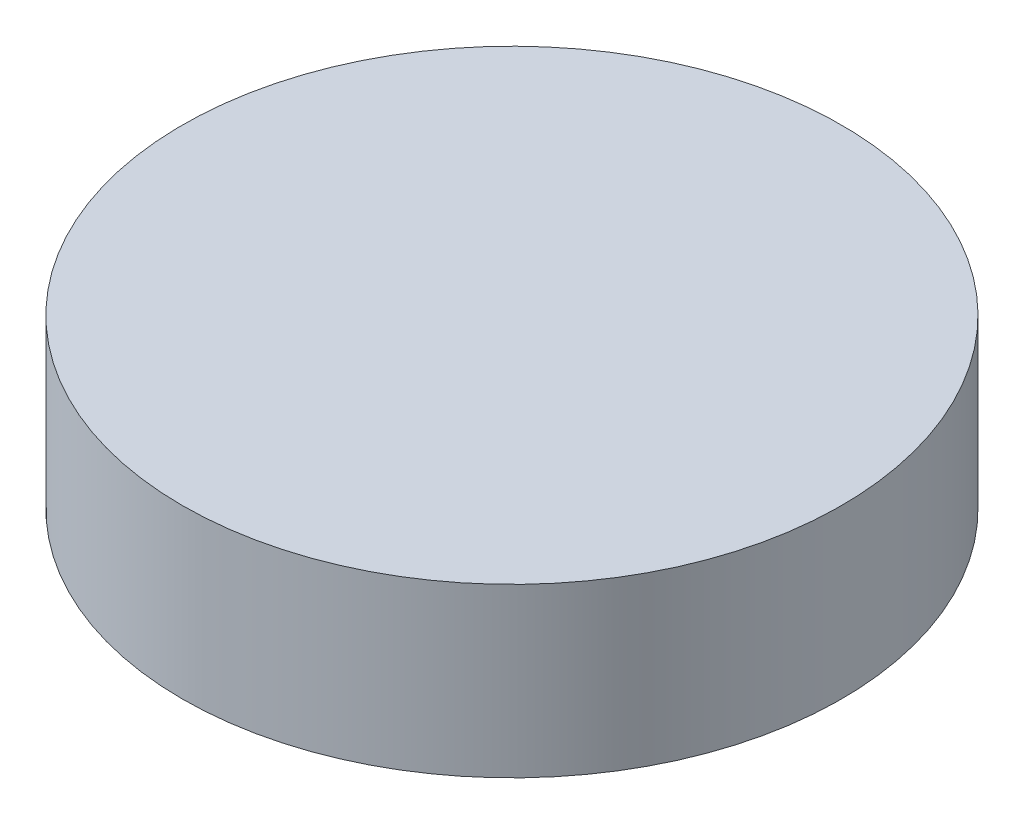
from build123d import *

# Parameters (mm, degrees)
SKETCH1_R           = 29.5
BOSS_EXTRUDE1_DEPTH = 15


with BuildPart() as part:
    # Sketch1 → Boss-Extrude1 (new body)
    with BuildSketch(Plane(origin=(0, 0, 0), x_dir=(1, 0, 0), z_dir=(0, 1, 0))):
        with Locations(Location((0, 0, 0), (0, 0, 270))):
            Circle(SKETCH1_R)
    extrude(amount=BOSS_EXTRUDE1_DEPTH)


solid = part.part
